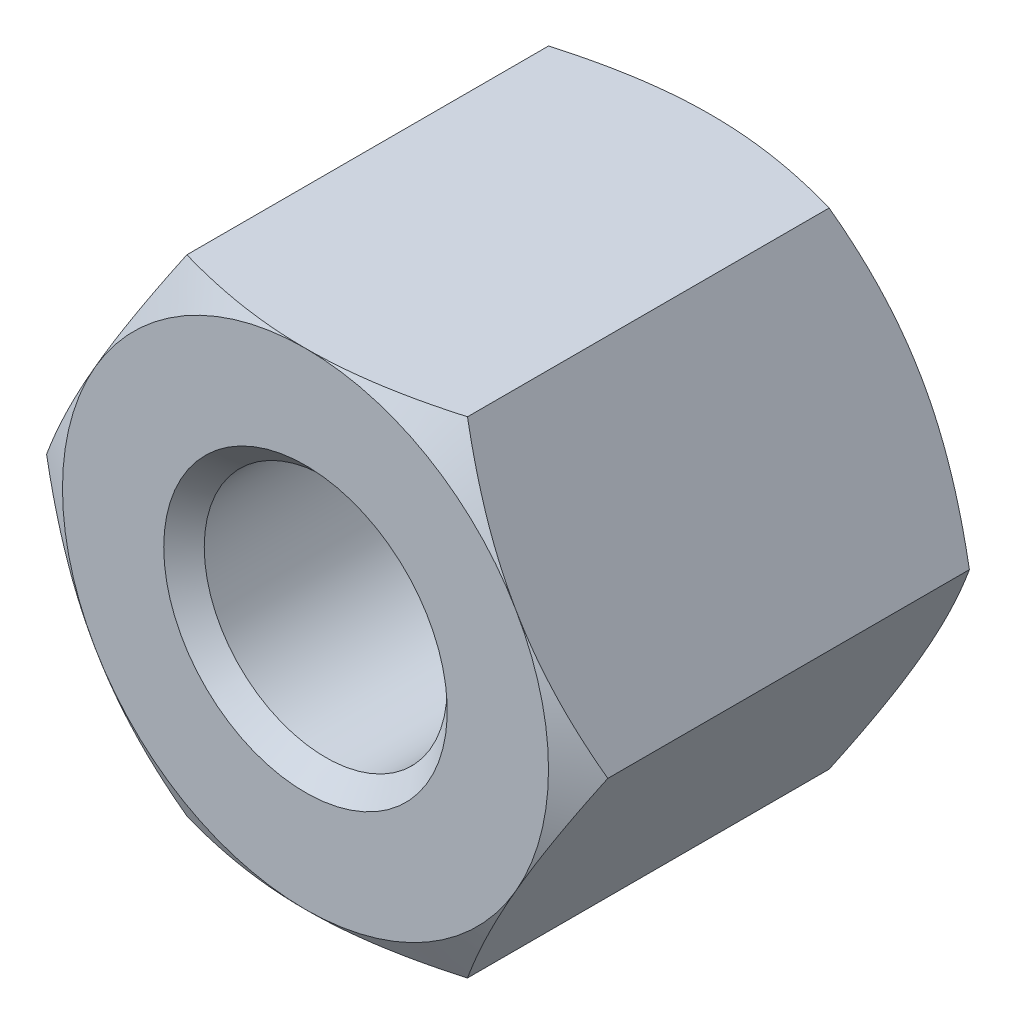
ISO-10303-21;
HEADER;
FILE_DESCRIPTION(('STEP AP214'),'2;1');
FILE_NAME('part.step','',(''),(''),'','','');
FILE_SCHEMA(('AUTOMOTIVE_DESIGN { 1 0 10303 214 1 1 1 1 }'));
ENDSEC;
DATA;
#1=APPLICATION_CONTEXT('core data for automotive mechanical design processes');
#2=APPLICATION_PROTOCOL_DEFINITION('international standard','automotive_design',2000,#1);
#3=PRODUCT_CONTEXT('',#1,'mechanical');
#4=PRODUCT('Part','Part','',(#3));
#5=PRODUCT_RELATED_PRODUCT_CATEGORY('part','',(#4));
#6=PRODUCT_DEFINITION_FORMATION('','',#4);
#7=PRODUCT_DEFINITION_CONTEXT('part definition',#1,'design');
#8=PRODUCT_DEFINITION('design','',#6,#7);
#9=PRODUCT_DEFINITION_SHAPE('','',#8);
#10=(LENGTH_UNIT() NAMED_UNIT(*) SI_UNIT(.MILLI.,.METRE.));
#11=(NAMED_UNIT(*) PLANE_ANGLE_UNIT() SI_UNIT($,.RADIAN.));
#12=(NAMED_UNIT(*) SI_UNIT($,.STERADIAN.) SOLID_ANGLE_UNIT());
#13=UNCERTAINTY_MEASURE_WITH_UNIT(LENGTH_MEASURE(1.E-05),#10,'distance_accuracy_value','');
#14=(GEOMETRIC_REPRESENTATION_CONTEXT(3) GLOBAL_UNCERTAINTY_ASSIGNED_CONTEXT((#13)) GLOBAL_UNIT_ASSIGNED_CONTEXT((#10,
#11,#12)) REPRESENTATION_CONTEXT('',''));
#15=CARTESIAN_POINT('',(0.,0.,0.));
#16=DIRECTION('',(0.,0.,1.));
#17=DIRECTION('',(1.,0.,0.));
#18=AXIS2_PLACEMENT_3D('',#15,#16,#17);
#19=CARTESIAN_POINT('',(3.46410161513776,0.,-2.5));
#20=DIRECTION('',(0.866025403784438,0.5,0.));
#21=DIRECTION('',(-0.5,0.866025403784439,0.));
#22=AXIS2_PLACEMENT_3D('',#19,#20,#21);
#23=PLANE('',#22);
#24=CARTESIAN_POINT('',(3.46421708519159,-0.000199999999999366,2.23198413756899));
#25=CARTESIAN_POINT('',(3.38810199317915,0.131635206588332,2.27594629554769));
#26=CARTESIAN_POINT('',(3.31132988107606,0.26460840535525,2.31592841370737));
#27=CARTESIAN_POINT('',(3.15645624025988,0.532857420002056,2.38571791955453));
#28=CARTESIAN_POINT('',(3.078351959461,0.668138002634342,2.41550061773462));
#29=CARTESIAN_POINT('',(2.92311136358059,0.937022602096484,2.46186216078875));
#30=CARTESIAN_POINT('',(2.84599893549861,1.07058524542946,2.47874955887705));
#31=CARTESIAN_POINT('',(2.6914112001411,1.33833905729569,2.49891035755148));
#32=CARTESIAN_POINT('',(2.61393645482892,1.47252925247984,2.50220045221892));
#33=CARTESIAN_POINT('',(2.46916798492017,1.72327559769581,2.49535946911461));
#34=CARTESIAN_POINT('',(2.40185259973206,1.83986926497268,2.48690808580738));
#35=CARTESIAN_POINT('',(2.2676603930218,2.07229698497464,2.46012105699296));
#36=CARTESIAN_POINT('',(2.2007840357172,2.18813023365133,2.44177625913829));
#37=CARTESIAN_POINT('',(2.06631510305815,2.42103725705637,2.39591524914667));
#38=CARTESIAN_POINT('',(1.99873954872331,2.53808155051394,2.36820461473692));
#39=CARTESIAN_POINT('',(1.86459637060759,2.77042435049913,2.3053122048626));
#40=CARTESIAN_POINT('',(1.79802702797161,2.88572583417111,2.27014520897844));
#41=CARTESIAN_POINT('',(1.73193533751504,3.0002,2.23198413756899));
#42=B_SPLINE_CURVE_WITH_KNOTS('',3,(#24,#25,#26,#27,#28,#29,#30,#31,#32,#33,#34,#35,#36,#37,#38,
#39,#40,#41),.UNSPECIFIED.,.F.,.F.,(4,2,2,2,2,2,2,2,4),(0.,0.475539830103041,0.952222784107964,
1.41710776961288,1.88142182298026,2.28572436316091,2.69040156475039,3.10405572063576,
3.5168974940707),.UNSPECIFIED.);
#43=CARTESIAN_POINT('',(3.46410161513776,0.,2.23205080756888));
#44=VERTEX_POINT('',#43);
#45=CARTESIAN_POINT('',(2.59807621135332,1.5,2.5));
#46=VERTEX_POINT('',#45);
#47=EDGE_CURVE('E127',#44,#46,#42,.T.);
#48=ORIENTED_EDGE('',*,*,#47,.F.);
#49=DIRECTION('',(0.,0.,1.));
#50=VECTOR('',#49,1.);
#51=CARTESIAN_POINT('',(3.46410161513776,0.,-2.5));
#52=LINE('',#51,#50);
#53=CARTESIAN_POINT('',(3.46410161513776,0.,-2.23205080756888));
#54=VERTEX_POINT('',#53);
#55=EDGE_CURVE('E565',#54,#44,#52,.T.);
#56=ORIENTED_EDGE('',*,*,#55,.F.);
#57=CARTESIAN_POINT('',(3.46421708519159,-0.000199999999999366,-2.23198413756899));
#58=CARTESIAN_POINT('',(3.38810199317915,0.131635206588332,-2.27594629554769));
#59=CARTESIAN_POINT('',(3.31132988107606,0.26460840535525,-2.31592841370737));
#60=CARTESIAN_POINT('',(3.15645624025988,0.532857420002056,-2.38571791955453));
#61=CARTESIAN_POINT('',(3.078351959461,0.668138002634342,-2.41550061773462));
#62=CARTESIAN_POINT('',(2.92311136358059,0.937022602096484,-2.46186216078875));
#63=CARTESIAN_POINT('',(2.84599893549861,1.07058524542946,-2.47874955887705));
#64=CARTESIAN_POINT('',(2.6914112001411,1.33833905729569,-2.49891035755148));
#65=CARTESIAN_POINT('',(2.61393645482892,1.47252925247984,-2.50220045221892));
#66=CARTESIAN_POINT('',(2.46916798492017,1.72327559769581,-2.49535946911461));
#67=CARTESIAN_POINT('',(2.40185259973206,1.83986926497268,-2.48690808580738));
#68=CARTESIAN_POINT('',(2.2676603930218,2.07229698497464,-2.46012105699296));
#69=CARTESIAN_POINT('',(2.2007840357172,2.18813023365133,-2.44177625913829));
#70=CARTESIAN_POINT('',(2.06631510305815,2.42103725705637,-2.39591524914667));
#71=CARTESIAN_POINT('',(1.99873954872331,2.53808155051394,-2.36820461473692));
#72=CARTESIAN_POINT('',(1.86459637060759,2.77042435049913,-2.3053122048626));
#73=CARTESIAN_POINT('',(1.79802702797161,2.88572583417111,-2.27014520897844));
#74=CARTESIAN_POINT('',(1.73193533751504,3.0002,-2.23198413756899));
#75=B_SPLINE_CURVE_WITH_KNOTS('',3,(#57,#58,#59,#60,#61,#62,#63,#64,#65,#66,#67,#68,#69,#70,#71,
#72,#73,#74),.UNSPECIFIED.,.F.,.F.,(4,2,2,2,2,2,2,2,4),(0.,0.475539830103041,0.952222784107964,
1.41710776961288,1.88142182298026,2.28572436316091,2.69040156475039,3.10405572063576,
3.5168974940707),.UNSPECIFIED.);
#76=CARTESIAN_POINT('',(2.59807621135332,1.5,-2.5));
#77=VERTEX_POINT('',#76);
#78=EDGE_CURVE('E577',#54,#77,#75,.T.);
#79=ORIENTED_EDGE('',*,*,#78,.T.);
#80=CARTESIAN_POINT('',(1.73205080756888,3.,-2.23205080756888));
#81=VERTEX_POINT('',#80);
#82=EDGE_CURVE('E269',#77,#81,#75,.T.);
#83=ORIENTED_EDGE('',*,*,#82,.T.);
#84=DIRECTION('',(0.,0.,1.));
#85=VECTOR('',#84,1.);
#86=CARTESIAN_POINT('',(1.73205080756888,3.,-2.5));
#87=LINE('',#86,#85);
#88=CARTESIAN_POINT('',(1.73205080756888,3.,2.23205080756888));
#89=VERTEX_POINT('',#88);
#90=EDGE_CURVE('E159',#81,#89,#87,.T.);
#91=ORIENTED_EDGE('',*,*,#90,.T.);
#92=EDGE_CURVE('E140',#46,#89,#42,.T.);
#93=ORIENTED_EDGE('',*,*,#92,.F.);
#94=EDGE_LOOP('',(#48,#56,#79,#83,#91,#93));
#95=FACE_BOUND('',#94,.T.);
#96=ADVANCED_FACE('F41',(#95),#23,.T.);
#97=CARTESIAN_POINT('',(1.73205080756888,-3.,-2.5));
#98=DIRECTION('',(0.866025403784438,-0.5,0.));
#99=DIRECTION('',(0.5,0.866025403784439,0.));
#100=AXIS2_PLACEMENT_3D('',#97,#98,#99);
#101=PLANE('',#100);
#102=CARTESIAN_POINT('',(1.73193533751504,-3.0002,2.23198413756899));
#103=CARTESIAN_POINT('',(1.80805042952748,-2.86836479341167,2.2759462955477));
#104=CARTESIAN_POINT('',(1.88482254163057,-2.73539159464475,2.31592841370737));
#105=CARTESIAN_POINT('',(2.03969618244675,-2.46714257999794,2.38571791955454));
#106=CARTESIAN_POINT('',(2.11780046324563,-2.33186199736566,2.41550061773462));
#107=CARTESIAN_POINT('',(2.27304105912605,-2.06297739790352,2.46186216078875));
#108=CARTESIAN_POINT('',(2.35015348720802,-1.92941475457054,2.47874955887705));
#109=CARTESIAN_POINT('',(2.50474122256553,-1.66166094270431,2.49891035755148));
#110=CARTESIAN_POINT('',(2.58221596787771,-1.52747074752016,2.50220045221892));
#111=CARTESIAN_POINT('',(2.72698443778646,-1.27672440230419,2.49535946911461));
#112=CARTESIAN_POINT('',(2.79429982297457,-1.16013073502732,2.48690808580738));
#113=CARTESIAN_POINT('',(2.92849202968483,-0.927703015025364,2.46012105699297));
#114=CARTESIAN_POINT('',(2.99536838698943,-0.811869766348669,2.44177625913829));
#115=CARTESIAN_POINT('',(3.12983731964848,-0.578962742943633,2.39591524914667));
#116=CARTESIAN_POINT('',(3.19741287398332,-0.461918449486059,2.36820461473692));
#117=CARTESIAN_POINT('',(3.33155605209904,-0.229575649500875,2.3053122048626));
#118=CARTESIAN_POINT('',(3.39812539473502,-0.114274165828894,2.27014520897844));
#119=CARTESIAN_POINT('',(3.46421708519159,0.000200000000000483,2.23198413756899));
#120=B_SPLINE_CURVE_WITH_KNOTS('',3,(#102,#103,#104,#105,#106,#107,#108,#109,#110,#111,#112,
#113,#114,#115,#116,#117,#118,#119),.UNSPECIFIED.,.F.,.F.,(4,2,2,2,2,2,2,2,4),(0.,
0.47553983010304,0.952222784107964,1.41710776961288,1.88142182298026,2.28572436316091,
2.69040156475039,3.10405572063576,3.5168974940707),.UNSPECIFIED.);
#121=CARTESIAN_POINT('',(1.73205080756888,-3.,2.23205080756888));
#122=VERTEX_POINT('',#121);
#123=CARTESIAN_POINT('',(2.59807621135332,-1.5,2.5));
#124=VERTEX_POINT('',#123);
#125=EDGE_CURVE('E537',#122,#124,#120,.T.);
#126=ORIENTED_EDGE('',*,*,#125,.F.);
#127=DIRECTION('',(0.,0.,1.));
#128=VECTOR('',#127,1.);
#129=CARTESIAN_POINT('',(1.73205080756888,-3.,-2.5));
#130=LINE('',#129,#128);
#131=CARTESIAN_POINT('',(1.73205080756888,-3.,-2.23205080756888));
#132=VERTEX_POINT('',#131);
#133=EDGE_CURVE('E283',#132,#122,#130,.T.);
#134=ORIENTED_EDGE('',*,*,#133,.F.);
#135=CARTESIAN_POINT('',(1.73193533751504,-3.0002,-2.23198413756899));
#136=CARTESIAN_POINT('',(1.80805042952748,-2.86836479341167,-2.2759462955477));
#137=CARTESIAN_POINT('',(1.88482254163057,-2.73539159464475,-2.31592841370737));
#138=CARTESIAN_POINT('',(2.03969618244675,-2.46714257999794,-2.38571791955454));
#139=CARTESIAN_POINT('',(2.11780046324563,-2.33186199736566,-2.41550061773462));
#140=CARTESIAN_POINT('',(2.27304105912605,-2.06297739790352,-2.46186216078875));
#141=CARTESIAN_POINT('',(2.35015348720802,-1.92941475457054,-2.47874955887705));
#142=CARTESIAN_POINT('',(2.50474122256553,-1.66166094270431,-2.49891035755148));
#143=CARTESIAN_POINT('',(2.58221596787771,-1.52747074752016,-2.50220045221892));
#144=CARTESIAN_POINT('',(2.72698443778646,-1.27672440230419,-2.49535946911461));
#145=CARTESIAN_POINT('',(2.79429982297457,-1.16013073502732,-2.48690808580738));
#146=CARTESIAN_POINT('',(2.92849202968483,-0.927703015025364,-2.46012105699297));
#147=CARTESIAN_POINT('',(2.99536838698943,-0.81186976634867,-2.44177625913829));
#148=CARTESIAN_POINT('',(3.12983731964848,-0.578962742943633,-2.39591524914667));
#149=CARTESIAN_POINT('',(3.19741287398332,-0.461918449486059,-2.36820461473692));
#150=CARTESIAN_POINT('',(3.33155605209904,-0.229575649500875,-2.3053122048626));
#151=CARTESIAN_POINT('',(3.39812539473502,-0.114274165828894,-2.27014520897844));
#152=CARTESIAN_POINT('',(3.46421708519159,0.000200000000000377,-2.23198413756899));
#153=B_SPLINE_CURVE_WITH_KNOTS('',3,(#135,#136,#137,#138,#139,#140,#141,#142,#143,#144,#145,
#146,#147,#148,#149,#150,#151,#152),.UNSPECIFIED.,.F.,.F.,(4,2,2,2,2,2,2,2,4),(0.,
0.47553983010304,0.952222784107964,1.41710776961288,1.88142182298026,2.28572436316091,
2.69040156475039,3.10405572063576,3.5168974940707),.UNSPECIFIED.);
#154=CARTESIAN_POINT('',(2.59807621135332,-1.5,-2.5));
#155=VERTEX_POINT('',#154);
#156=EDGE_CURVE('E566',#132,#155,#153,.T.);
#157=ORIENTED_EDGE('',*,*,#156,.T.);
#158=EDGE_CURVE('E284',#155,#54,#153,.T.);
#159=ORIENTED_EDGE('',*,*,#158,.T.);
#160=ORIENTED_EDGE('',*,*,#55,.T.);
#161=EDGE_CURVE('E132',#124,#44,#120,.T.);
#162=ORIENTED_EDGE('',*,*,#161,.F.);
#163=EDGE_LOOP('',(#126,#134,#157,#159,#160,#162));
#164=FACE_BOUND('',#163,.T.);
#165=ADVANCED_FACE('F254',(#164),#101,.T.);
#166=CARTESIAN_POINT('',(-1.73205080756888,-3.,-2.5));
#167=DIRECTION('',(0.,-1.,0.));
#168=DIRECTION('',(0.,0.,-1.));
#169=AXIS2_PLACEMENT_3D('',#166,#167,#168);
#170=PLANE('',#169);
#171=CARTESIAN_POINT('',(-7.17784978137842,-3.,-0.259479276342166));
#172=CARTESIAN_POINT('',(-7.01558245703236,-3.,-0.17304899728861));
#173=CARTESIAN_POINT('',(-6.85314037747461,-3.,-0.0869447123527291));
#174=CARTESIAN_POINT('',(-6.52782194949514,-3.,0.0844422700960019));
#175=CARTESIAN_POINT('',(-6.36494559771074,-3.,0.169724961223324));
#176=CARTESIAN_POINT('',(-6.03850024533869,-3.,0.339389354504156));
#177=CARTESIAN_POINT('',(-5.87493068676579,-3.,0.423769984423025));
#178=CARTESIAN_POINT('',(-5.54716008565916,-3.,0.59130132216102));
#179=CARTESIAN_POINT('',(-5.38295903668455,-3.,0.674452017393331));
#180=CARTESIAN_POINT('',(-5.04495709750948,-3.,0.843633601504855));
#181=CARTESIAN_POINT('',(-4.87111370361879,-3.,0.929579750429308));
#182=CARTESIAN_POINT('',(-4.5223603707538,-3.,1.09927115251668));
#183=CARTESIAN_POINT('',(-4.34745046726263,-3.,1.18301647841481));
#184=CARTESIAN_POINT('',(-3.99636183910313,-3.,1.34758690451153));
#185=CARTESIAN_POINT('',(-3.8201837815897,-3.,1.42841342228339));
#186=CARTESIAN_POINT('',(-3.46607843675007,-3.,1.58623509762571));
#187=CARTESIAN_POINT('',(-3.28815088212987,-3.,1.66322965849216));
#188=CARTESIAN_POINT('',(-2.91647223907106,-3.,1.8176583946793));
#189=CARTESIAN_POINT('',(-2.72254790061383,-3.,1.89467962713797));
#190=CARTESIAN_POINT('',(-2.33152787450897,-3.,2.04012175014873));
#191=CARTESIAN_POINT('',(-2.13443332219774,-3.,2.10854564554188));
#192=CARTESIAN_POINT('',(-1.74010191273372,-3.,2.23196477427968));
#193=CARTESIAN_POINT('',(-1.54293858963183,-3.,2.28718999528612));
#194=CARTESIAN_POINT('',(-1.14468045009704,-3.,2.38115539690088));
#195=CARTESIAN_POINT('',(-0.943587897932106,-3.,2.41990479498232));
#196=CARTESIAN_POINT('',(-0.575005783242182,-3.,2.47092360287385));
#197=CARTESIAN_POINT('',(-0.408015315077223,-3.,2.48671427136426));
#198=CARTESIAN_POINT('',(-0.073326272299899,-3.,2.50215643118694));
#199=CARTESIAN_POINT('',(0.0943720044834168,-3.,2.50181414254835));
#200=CARTESIAN_POINT('',(0.43190307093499,-3.,2.48488633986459));
#201=CARTESIAN_POINT('',(0.601721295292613,-3.,2.46801424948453));
#202=CARTESIAN_POINT('',(0.854800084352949,-3.,2.43168509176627));
#203=CARTESIAN_POINT('',(0.938905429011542,-3.,2.41773374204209));
#204=CARTESIAN_POINT('',(1.10649467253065,-3.,2.38651079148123));
#205=CARTESIAN_POINT('',(1.18997860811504,-3.,2.36923938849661));
#206=CARTESIAN_POINT('',(1.408843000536,-3.,2.31987785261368));
#207=CARTESIAN_POINT('',(1.54366734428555,-3.,2.28532210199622));
#208=CARTESIAN_POINT('',(1.81152764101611,-3.,2.20984458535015));
#209=CARTESIAN_POINT('',(1.94456313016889,-3.,2.16892120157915));
#210=CARTESIAN_POINT('',(2.20914170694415,-3.,2.08197641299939));
#211=CARTESIAN_POINT('',(2.34068255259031,-3.,2.03594824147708));
#212=CARTESIAN_POINT('',(2.60227812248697,-3.,1.93991466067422));
#213=CARTESIAN_POINT('',(2.73233299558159,-3.,1.88990965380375));
#214=CARTESIAN_POINT('',(2.99202121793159,-3.,1.78642175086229));
#215=CARTESIAN_POINT('',(3.12164639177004,-3.,1.73291844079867));
#216=CARTESIAN_POINT('',(3.37982130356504,-3.,1.62337600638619));
#217=CARTESIAN_POINT('',(3.50837100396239,-3.,1.56733679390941));
#218=CARTESIAN_POINT('',(3.89248803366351,-3.,1.39628235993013));
#219=CARTESIAN_POINT('',(4.1467116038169,-3.,1.27825347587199));
#220=CARTESIAN_POINT('',(4.63589269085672,-3.,1.04489196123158));
#221=CARTESIAN_POINT('',(4.87101297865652,-3.,0.929896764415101));
#222=CARTESIAN_POINT('',(5.33966516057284,-3.,0.696613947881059));
#223=CARTESIAN_POINT('',(5.57319675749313,-3.,0.578325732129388));
#224=CARTESIAN_POINT('',(6.03578043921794,-3.,0.34105697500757));
#225=CARTESIAN_POINT('',(6.2648494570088,-3.,0.22210932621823));
#226=CARTESIAN_POINT('',(6.72200542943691,-3.,-0.0175153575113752));
#227=CARTESIAN_POINT('',(6.95009262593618,-3.,-0.13819193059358));
#228=CARTESIAN_POINT('',(7.17784978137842,-3.,-0.259479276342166));
#229=B_SPLINE_CURVE_WITH_KNOTS('',3,(#171,#172,#173,#174,#175,#176,#177,#178,#179,#180,#181,
#182,#183,#184,#185,#186,#187,#188,#189,#190,#191,#192,#193,#194,#195,#196,#197,#198,#199,#200,
#201,#202,#203,#204,#205,#206,#207,#208,#209,#210,#211,#212,#213,#214,#215,#216,#217,#218,#219,
#220,#221,#222,#223,#224,#225,#226,#227,#228),.UNSPECIFIED.,.F.,.F.,(4,2,2,2,2,2,2,2,2,2,2,2,2,
2,2,2,2,2,2,2,2,2,2,2,2,2,2,2,4),(0.,0.55155154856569,1.10310738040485,1.6552587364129,
2.20741573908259,2.78918936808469,3.37094374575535,3.95241167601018,4.53396986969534,
5.15981071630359,5.78543221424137,6.39919323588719,7.01261043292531,7.51510497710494,
8.0174057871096,8.52857189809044,8.78428091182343,9.03997469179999,9.4573109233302,
9.8747533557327,10.2927559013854,10.7107162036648,11.1313814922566,11.5520614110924,
12.3928113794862,13.177990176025,13.9633120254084,14.7376363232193,15.5117574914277),.UNSPECIFIED.);
#230=CARTESIAN_POINT('',(-1.73205080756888,-3.,2.23205080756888));
#231=VERTEX_POINT('',#230);
#232=CARTESIAN_POINT('',(0.,-3.,2.5));
#233=VERTEX_POINT('',#232);
#234=EDGE_CURVE('E538',#231,#233,#229,.T.);
#235=ORIENTED_EDGE('',*,*,#234,.F.);
#236=DIRECTION('',(0.,0.,1.));
#237=VECTOR('',#236,1.);
#238=CARTESIAN_POINT('',(-1.73205080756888,-3.,-2.5));
#239=LINE('',#238,#237);
#240=CARTESIAN_POINT('',(-1.73205080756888,-3.,-2.23205080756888));
#241=VERTEX_POINT('',#240);
#242=EDGE_CURVE('E545',#241,#231,#239,.T.);
#243=ORIENTED_EDGE('',*,*,#242,.F.);
#244=CARTESIAN_POINT('',(-5.96096657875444,-3.,-0.379211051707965));
#245=CARTESIAN_POINT('',(-5.82229549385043,-3.,-0.450717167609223));
#246=CARTESIAN_POINT('',(-5.68342500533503,-3.,-0.521839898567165));
#247=CARTESIAN_POINT('',(-5.4051938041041,-3.,-0.663125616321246));
#248=CARTESIAN_POINT('',(-5.26583308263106,-3.,-0.733288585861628));
#249=CARTESIAN_POINT('',(-4.98631052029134,-3.,-0.872571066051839));
#250=CARTESIAN_POINT('',(-4.84614775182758,-3.,-0.941688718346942));
#251=CARTESIAN_POINT('',(-4.56512520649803,-3.,-1.07849952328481));
#252=CARTESIAN_POINT('',(-4.42426541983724,-3.,-1.14619265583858));
#253=CARTESIAN_POINT('',(-4.13421051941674,-3.,-1.28335591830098));
#254=CARTESIAN_POINT('',(-3.98496973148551,-3.,-1.35272973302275));
#255=CARTESIAN_POINT('',(-3.68535367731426,-3.,-1.48898030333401));
#256=CARTESIAN_POINT('',(-3.53497844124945,-3.,-1.55585712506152));
#257=CARTESIAN_POINT('',(-3.23293144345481,-3.,-1.68634814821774));
#258=CARTESIAN_POINT('',(-3.08126062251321,-3.,-1.74996451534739));
#259=CARTESIAN_POINT('',(-2.77617994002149,-3.,-1.87300741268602));
#260=CARTESIAN_POINT('',(-2.62276968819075,-3.,-1.93243298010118));
#261=CARTESIAN_POINT('',(-2.28978004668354,-3.,-2.05458664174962));
#262=CARTESIAN_POINT('',(-2.10985340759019,-3.,-2.11638252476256));
#263=CARTESIAN_POINT('',(-1.74684035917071,-3.,-2.22970634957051));
#264=CARTESIAN_POINT('',(-1.56375558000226,-3.,-2.28123942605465));
#265=CARTESIAN_POINT('',(-1.19765579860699,-3.,-2.36949196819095));
#266=CARTESIAN_POINT('',(-1.01470769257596,-3.,-2.40647822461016));
#267=CARTESIAN_POINT('',(-0.73834410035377,-3.,-2.44905252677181));
#268=CARTESIAN_POINT('',(-0.645908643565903,-3.,-2.46109255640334));
#269=CARTESIAN_POINT('',(-0.460553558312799,-3.,-2.48049771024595));
#270=CARTESIAN_POINT('',(-0.367634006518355,-3.,-2.48786355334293));
#271=CARTESIAN_POINT('',(-0.180216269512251,-3.,-2.49772601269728));
#272=CARTESIAN_POINT('',(-0.0857143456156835,-3.,-2.50015228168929));
#273=CARTESIAN_POINT('',(0.103280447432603,-3.,-2.49983287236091));
#274=CARTESIAN_POINT('',(0.197773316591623,-3.,-2.49708719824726));
#275=CARTESIAN_POINT('',(0.386491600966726,-3.,-2.48652759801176));
#276=CARTESIAN_POINT('',(0.480716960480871,-3.,-2.47871268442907));
#277=CARTESIAN_POINT('',(0.66865400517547,-3.,-2.45830072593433));
#278=CARTESIAN_POINT('',(0.762365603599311,-3.,-2.44570289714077));
#279=CARTESIAN_POINT('',(1.04621628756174,-3.,-2.40074314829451));
#280=CARTESIAN_POINT('',(1.23527267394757,-3.,-2.36145296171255));
#281=CARTESIAN_POINT('',(1.60983106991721,-3.,-2.26882483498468));
#282=CARTESIAN_POINT('',(1.79533187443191,-3.,-2.21548221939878));
#283=CARTESIAN_POINT('',(2.15763999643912,-3.,-2.10028779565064));
#284=CARTESIAN_POINT('',(2.33454275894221,-3.,-2.0387312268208));
#285=CARTESIAN_POINT('',(2.68576747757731,-3.,-1.90860477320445));
#286=CARTESIAN_POINT('',(2.86008876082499,-3.,-1.8400330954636));
#287=CARTESIAN_POINT('',(3.2068164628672,-3.,-1.69769936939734));
#288=CARTESIAN_POINT('',(3.37922045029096,-3.,-1.62393144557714));
#289=CARTESIAN_POINT('',(3.72232923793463,-3.,-1.47261306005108));
#290=CARTESIAN_POINT('',(3.89303421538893,-3.,-1.39506299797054));
#291=CARTESIAN_POINT('',(4.22332235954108,-3.,-1.24165474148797));
#292=CARTESIAN_POINT('',(4.38297998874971,-3.,-1.16595621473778));
#293=CARTESIAN_POINT('',(4.70134647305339,-3.,-1.01258026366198));
#294=CARTESIAN_POINT('',(4.86005529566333,-3.,-0.934902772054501));
#295=CARTESIAN_POINT('',(5.17616234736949,-3.,-0.778256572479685));
#296=CARTESIAN_POINT('',(5.33356319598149,-3.,-0.699293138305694));
#297=CARTESIAN_POINT('',(5.64771538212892,-3.,-0.54011749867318));
#298=CARTESIAN_POINT('',(5.80446677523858,-3.,-0.459905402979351));
#299=CARTESIAN_POINT('',(5.96096657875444,-3.,-0.379211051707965));
#300=B_SPLINE_CURVE_WITH_KNOTS('',3,(#244,#245,#246,#247,#248,#249,#250,#251,#252,#253,#254,
#255,#256,#257,#258,#259,#260,#261,#262,#263,#264,#265,#266,#267,#268,#269,#270,#271,#272,#273,
#274,#275,#276,#277,#278,#279,#280,#281,#282,#283,#284,#285,#286,#287,#288,#289,#290,#291,#292,
#293,#294,#295,#296,#297,#298,#299),.UNSPECIFIED.,.F.,.F.,(4,2,2,2,2,2,2,2,2,2,2,2,2,2,2,2,2,2,
2,2,2,2,2,2,2,2,2,4),(0.,0.468066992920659,0.93614239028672,1.40497010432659,1.87380442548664,
2.36751699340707,2.86121647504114,3.3545836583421,3.84806382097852,4.41856654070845,
4.98878310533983,5.54799077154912,5.82753886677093,6.10704395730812,6.39050255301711,
6.67396091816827,6.95747451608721,7.24103459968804,7.81952256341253,8.39820324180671,
8.95992231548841,9.52178531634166,10.0842941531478,10.6467436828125,11.1768095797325,
11.7068935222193,12.2351793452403,12.7634189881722),.UNSPECIFIED.);
#301=CARTESIAN_POINT('',(0.,-3.,-2.5));
#302=VERTEX_POINT('',#301);
#303=EDGE_CURVE('E534',#241,#302,#300,.T.);
#304=ORIENTED_EDGE('',*,*,#303,.T.);
#305=EDGE_CURVE('E259',#302,#132,#300,.T.);
#306=ORIENTED_EDGE('',*,*,#305,.T.);
#307=ORIENTED_EDGE('',*,*,#133,.T.);
#308=EDGE_CURVE('E138',#233,#122,#229,.T.);
#309=ORIENTED_EDGE('',*,*,#308,.F.);
#310=EDGE_LOOP('',(#235,#243,#304,#306,#307,#309));
#311=FACE_BOUND('',#310,.T.);
#312=ADVANCED_FACE('F292',(#311),#170,.T.);
#313=CARTESIAN_POINT('',(-3.46410161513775,0.,-2.5));
#314=DIRECTION('',(-0.866025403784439,-0.5,0.));
#315=DIRECTION('',(0.5,-0.866025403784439,0.));
#316=AXIS2_PLACEMENT_3D('',#313,#314,#315);
#317=PLANE('',#316);
#318=CARTESIAN_POINT('',(-3.46421708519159,0.000200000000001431,2.23198413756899));
#319=CARTESIAN_POINT('',(-3.38810199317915,-0.131635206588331,2.2759462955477));
#320=CARTESIAN_POINT('',(-3.31132988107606,-0.264608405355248,2.31592841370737));
#321=CARTESIAN_POINT('',(-3.15645624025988,-0.532857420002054,2.38571791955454));
#322=CARTESIAN_POINT('',(-3.078351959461,-0.66813800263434,2.41550061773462));
#323=CARTESIAN_POINT('',(-2.92311136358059,-0.937022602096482,2.46186216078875));
#324=CARTESIAN_POINT('',(-2.84599893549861,-1.07058524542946,2.47874955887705));
#325=CARTESIAN_POINT('',(-2.6914112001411,-1.33833905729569,2.49891035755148));
#326=CARTESIAN_POINT('',(-2.61393645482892,-1.47252925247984,2.50220045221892));
#327=CARTESIAN_POINT('',(-2.46916798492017,-1.72327559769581,2.49535946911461));
#328=CARTESIAN_POINT('',(-2.40185259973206,-1.83986926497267,2.48690808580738));
#329=CARTESIAN_POINT('',(-2.2676603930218,-2.07229698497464,2.46012105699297));
#330=CARTESIAN_POINT('',(-2.2007840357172,-2.18813023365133,2.44177625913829));
#331=CARTESIAN_POINT('',(-2.06631510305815,-2.42103725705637,2.39591524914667));
#332=CARTESIAN_POINT('',(-1.99873954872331,-2.53808155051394,2.36820461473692));
#333=CARTESIAN_POINT('',(-1.86459637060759,-2.77042435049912,2.3053122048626));
#334=CARTESIAN_POINT('',(-1.79802702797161,-2.88572583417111,2.27014520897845));
#335=CARTESIAN_POINT('',(-1.73193533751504,-3.0002,2.23198413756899));
#336=B_SPLINE_CURVE_WITH_KNOTS('',3,(#318,#319,#320,#321,#322,#323,#324,#325,#326,#327,#328,
#329,#330,#331,#332,#333,#334,#335),.UNSPECIFIED.,.F.,.F.,(4,2,2,2,2,2,2,2,4),(0.,
0.475539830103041,0.952222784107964,1.41710776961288,1.88142182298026,2.28572436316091,
2.69040156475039,3.10405572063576,3.5168974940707),.UNSPECIFIED.);
#337=CARTESIAN_POINT('',(-3.46410161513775,0.,2.23205080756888));
#338=VERTEX_POINT('',#337);
#339=CARTESIAN_POINT('',(-2.59807621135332,-1.5,2.5));
#340=VERTEX_POINT('',#339);
#341=EDGE_CURVE('E176',#338,#340,#336,.T.);
#342=ORIENTED_EDGE('',*,*,#341,.F.);
#343=DIRECTION('',(0.,0.,1.));
#344=VECTOR('',#343,1.);
#345=CARTESIAN_POINT('',(-3.46410161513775,0.,-2.5));
#346=LINE('',#345,#344);
#347=CARTESIAN_POINT('',(-3.46410161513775,0.,-2.23205080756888));
#348=VERTEX_POINT('',#347);
#349=EDGE_CURVE('E553',#348,#338,#346,.T.);
#350=ORIENTED_EDGE('',*,*,#349,.F.);
#351=CARTESIAN_POINT('',(-3.46421708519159,0.000200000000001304,-2.23198413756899));
#352=CARTESIAN_POINT('',(-3.38810199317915,-0.131635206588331,-2.2759462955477));
#353=CARTESIAN_POINT('',(-3.31132988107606,-0.264608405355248,-2.31592841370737));
#354=CARTESIAN_POINT('',(-3.15645624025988,-0.532857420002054,-2.38571791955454));
#355=CARTESIAN_POINT('',(-3.078351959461,-0.66813800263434,-2.41550061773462));
#356=CARTESIAN_POINT('',(-2.92311136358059,-0.937022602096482,-2.46186216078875));
#357=CARTESIAN_POINT('',(-2.84599893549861,-1.07058524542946,-2.47874955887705));
#358=CARTESIAN_POINT('',(-2.6914112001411,-1.33833905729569,-2.49891035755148));
#359=CARTESIAN_POINT('',(-2.61393645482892,-1.47252925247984,-2.50220045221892));
#360=CARTESIAN_POINT('',(-2.46916798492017,-1.72327559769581,-2.49535946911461));
#361=CARTESIAN_POINT('',(-2.40185259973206,-1.83986926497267,-2.48690808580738));
#362=CARTESIAN_POINT('',(-2.2676603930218,-2.07229698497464,-2.46012105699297));
#363=CARTESIAN_POINT('',(-2.2007840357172,-2.18813023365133,-2.44177625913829));
#364=CARTESIAN_POINT('',(-2.06631510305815,-2.42103725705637,-2.39591524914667));
#365=CARTESIAN_POINT('',(-1.99873954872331,-2.53808155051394,-2.36820461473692));
#366=CARTESIAN_POINT('',(-1.86459637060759,-2.77042435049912,-2.3053122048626));
#367=CARTESIAN_POINT('',(-1.79802702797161,-2.88572583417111,-2.27014520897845));
#368=CARTESIAN_POINT('',(-1.73193533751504,-3.0002,-2.23198413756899));
#369=B_SPLINE_CURVE_WITH_KNOTS('',3,(#351,#352,#353,#354,#355,#356,#357,#358,#359,#360,#361,
#362,#363,#364,#365,#366,#367,#368),.UNSPECIFIED.,.F.,.F.,(4,2,2,2,2,2,2,2,4),(0.,
0.475539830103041,0.952222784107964,1.41710776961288,1.88142182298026,2.28572436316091,
2.69040156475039,3.10405572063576,3.5168974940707),.UNSPECIFIED.);
#370=CARTESIAN_POINT('',(-2.59807621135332,-1.5,-2.5));
#371=VERTEX_POINT('',#370);
#372=EDGE_CURVE('E275',#348,#371,#369,.T.);
#373=ORIENTED_EDGE('',*,*,#372,.T.);
#374=EDGE_CURVE('E282',#371,#241,#369,.T.);
#375=ORIENTED_EDGE('',*,*,#374,.T.);
#376=ORIENTED_EDGE('',*,*,#242,.T.);
#377=EDGE_CURVE('E548',#340,#231,#336,.T.);
#378=ORIENTED_EDGE('',*,*,#377,.F.);
#379=EDGE_LOOP('',(#342,#350,#373,#375,#376,#378));
#380=FACE_BOUND('',#379,.T.);
#381=ADVANCED_FACE('F289',(#380),#317,.T.);
#382=CARTESIAN_POINT('',(-1.73205080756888,3.,-2.5));
#383=DIRECTION('',(-0.866025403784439,0.5,0.));
#384=DIRECTION('',(-0.5,-0.866025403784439,0.));
#385=AXIS2_PLACEMENT_3D('',#382,#383,#384);
#386=PLANE('',#385);
#387=CARTESIAN_POINT('',(-1.73193533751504,3.0002,2.23198413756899));
#388=CARTESIAN_POINT('',(-1.80805042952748,2.86836479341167,2.27594629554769));
#389=CARTESIAN_POINT('',(-1.88482254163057,2.73539159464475,2.31592841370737));
#390=CARTESIAN_POINT('',(-2.03969618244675,2.46714257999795,2.38571791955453));
#391=CARTESIAN_POINT('',(-2.11780046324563,2.33186199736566,2.41550061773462));
#392=CARTESIAN_POINT('',(-2.27304105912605,2.06297739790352,2.46186216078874));
#393=CARTESIAN_POINT('',(-2.35015348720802,1.92941475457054,2.47874955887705));
#394=CARTESIAN_POINT('',(-2.50474122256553,1.66166094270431,2.49891035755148));
#395=CARTESIAN_POINT('',(-2.58221596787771,1.52747074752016,2.50220045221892));
#396=CARTESIAN_POINT('',(-2.72698443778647,1.27672440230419,2.49535946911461));
#397=CARTESIAN_POINT('',(-2.79429982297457,1.16013073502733,2.48690808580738));
#398=CARTESIAN_POINT('',(-2.92849202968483,0.927703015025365,2.46012105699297));
#399=CARTESIAN_POINT('',(-2.99536838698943,0.81186976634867,2.44177625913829));
#400=CARTESIAN_POINT('',(-3.12983731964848,0.578962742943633,2.39591524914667));
#401=CARTESIAN_POINT('',(-3.19741287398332,0.46191844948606,2.36820461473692));
#402=CARTESIAN_POINT('',(-3.33155605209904,0.229575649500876,2.3053122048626));
#403=CARTESIAN_POINT('',(-3.39812539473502,0.114274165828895,2.27014520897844));
#404=CARTESIAN_POINT('',(-3.46421708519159,-0.000199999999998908,2.23198413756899));
#405=B_SPLINE_CURVE_WITH_KNOTS('',3,(#387,#388,#389,#390,#391,#392,#393,#394,#395,#396,#397,
#398,#399,#400,#401,#402,#403,#404),.UNSPECIFIED.,.F.,.F.,(4,2,2,2,2,2,2,2,4),(0.,
0.47553983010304,0.952222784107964,1.41710776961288,1.88142182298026,2.28572436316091,
2.69040156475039,3.10405572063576,3.5168974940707),.UNSPECIFIED.);
#406=CARTESIAN_POINT('',(-1.73205080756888,3.,2.23205080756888));
#407=VERTEX_POINT('',#406);
#408=CARTESIAN_POINT('',(-2.59807621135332,1.5,2.5));
#409=VERTEX_POINT('',#408);
#410=EDGE_CURVE('E183',#407,#409,#405,.T.);
#411=ORIENTED_EDGE('',*,*,#410,.F.);
#412=DIRECTION('',(0.,0.,1.));
#413=VECTOR('',#412,1.);
#414=CARTESIAN_POINT('',(-1.73205080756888,3.,-2.5));
#415=LINE('',#414,#413);
#416=CARTESIAN_POINT('',(-1.73205080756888,3.,-2.23205080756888));
#417=VERTEX_POINT('',#416);
#418=EDGE_CURVE('E233',#417,#407,#415,.T.);
#419=ORIENTED_EDGE('',*,*,#418,.F.);
#420=CARTESIAN_POINT('',(-1.73193533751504,3.0002,-2.23198413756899));
#421=CARTESIAN_POINT('',(-1.80805042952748,2.86836479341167,-2.27594629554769));
#422=CARTESIAN_POINT('',(-1.88482254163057,2.73539159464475,-2.31592841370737));
#423=CARTESIAN_POINT('',(-2.03969618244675,2.46714257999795,-2.38571791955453));
#424=CARTESIAN_POINT('',(-2.11780046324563,2.33186199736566,-2.41550061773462));
#425=CARTESIAN_POINT('',(-2.27304105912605,2.06297739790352,-2.46186216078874));
#426=CARTESIAN_POINT('',(-2.35015348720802,1.92941475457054,-2.47874955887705));
#427=CARTESIAN_POINT('',(-2.50474122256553,1.66166094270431,-2.49891035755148));
#428=CARTESIAN_POINT('',(-2.58221596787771,1.52747074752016,-2.50220045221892));
#429=CARTESIAN_POINT('',(-2.72698443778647,1.27672440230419,-2.49535946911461));
#430=CARTESIAN_POINT('',(-2.79429982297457,1.16013073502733,-2.48690808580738));
#431=CARTESIAN_POINT('',(-2.92849202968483,0.927703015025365,-2.46012105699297));
#432=CARTESIAN_POINT('',(-2.99536838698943,0.81186976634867,-2.44177625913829));
#433=CARTESIAN_POINT('',(-3.12983731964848,0.578962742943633,-2.39591524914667));
#434=CARTESIAN_POINT('',(-3.19741287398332,0.46191844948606,-2.36820461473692));
#435=CARTESIAN_POINT('',(-3.33155605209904,0.229575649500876,-2.3053122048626));
#436=CARTESIAN_POINT('',(-3.39812539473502,0.114274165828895,-2.27014520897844));
#437=CARTESIAN_POINT('',(-3.46421708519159,-0.000199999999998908,-2.23198413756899));
#438=B_SPLINE_CURVE_WITH_KNOTS('',3,(#420,#421,#422,#423,#424,#425,#426,#427,#428,#429,#430,
#431,#432,#433,#434,#435,#436,#437),.UNSPECIFIED.,.F.,.F.,(4,2,2,2,2,2,2,2,4),(0.,
0.47553983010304,0.952222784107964,1.41710776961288,1.88142182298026,2.28572436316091,
2.69040156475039,3.10405572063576,3.5168974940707),.UNSPECIFIED.);
#439=CARTESIAN_POINT('',(-2.59807621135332,1.5,-2.5));
#440=VERTEX_POINT('',#439);
#441=EDGE_CURVE('E237',#417,#440,#438,.T.);
#442=ORIENTED_EDGE('',*,*,#441,.T.);
#443=EDGE_CURVE('E544',#440,#348,#438,.T.);
#444=ORIENTED_EDGE('',*,*,#443,.T.);
#445=ORIENTED_EDGE('',*,*,#349,.T.);
#446=EDGE_CURVE('E607',#409,#338,#405,.T.);
#447=ORIENTED_EDGE('',*,*,#446,.F.);
#448=EDGE_LOOP('',(#411,#419,#442,#444,#445,#447));
#449=FACE_BOUND('',#448,.T.);
#450=ADVANCED_FACE('F218',(#449),#386,.T.);
#451=CARTESIAN_POINT('',(1.73205080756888,3.,-2.5));
#452=DIRECTION('',(0.,1.,0.));
#453=DIRECTION('',(-1.,0.,0.));
#454=AXIS2_PLACEMENT_3D('',#451,#452,#453);
#455=PLANE('',#454);
#456=CARTESIAN_POINT('',(7.17784978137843,3.,-0.25947927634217));
#457=CARTESIAN_POINT('',(7.01558245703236,3.,-0.173048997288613));
#458=CARTESIAN_POINT('',(6.85314037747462,3.,-0.0869447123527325));
#459=CARTESIAN_POINT('',(6.52782194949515,3.,0.0844422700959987));
#460=CARTESIAN_POINT('',(6.36494559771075,3.,0.169724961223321));
#461=CARTESIAN_POINT('',(6.03850024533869,3.,0.339389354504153));
#462=CARTESIAN_POINT('',(5.8749306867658,3.,0.423769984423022));
#463=CARTESIAN_POINT('',(5.54716008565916,3.,0.591301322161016));
#464=CARTESIAN_POINT('',(5.38295903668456,3.,0.674452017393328));
#465=CARTESIAN_POINT('',(5.04495709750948,3.,0.843633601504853));
#466=CARTESIAN_POINT('',(4.8711137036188,3.,0.929579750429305));
#467=CARTESIAN_POINT('',(4.5223603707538,3.,1.09927115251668));
#468=CARTESIAN_POINT('',(4.34745046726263,3.,1.18301647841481));
#469=CARTESIAN_POINT('',(3.99636183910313,3.,1.34758690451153));
#470=CARTESIAN_POINT('',(3.8201837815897,3.,1.42841342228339));
#471=CARTESIAN_POINT('',(3.46607843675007,3.,1.58623509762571));
#472=CARTESIAN_POINT('',(3.28815088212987,3.,1.66322965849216));
#473=CARTESIAN_POINT('',(2.91647223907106,3.,1.8176583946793));
#474=CARTESIAN_POINT('',(2.72254790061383,3.,1.89467962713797));
#475=CARTESIAN_POINT('',(2.33152787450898,3.,2.04012175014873));
#476=CARTESIAN_POINT('',(2.13443332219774,3.,2.10854564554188));
#477=CARTESIAN_POINT('',(1.74010191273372,3.,2.23196477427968));
#478=CARTESIAN_POINT('',(1.54293858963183,3.,2.28718999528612));
#479=CARTESIAN_POINT('',(1.14468045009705,3.,2.38115539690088));
#480=CARTESIAN_POINT('',(0.943587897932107,3.,2.41990479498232));
#481=CARTESIAN_POINT('',(0.575005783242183,3.,2.47092360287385));
#482=CARTESIAN_POINT('',(0.408015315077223,3.,2.48671427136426));
#483=CARTESIAN_POINT('',(0.073326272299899,3.,2.50215643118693));
#484=CARTESIAN_POINT('',(-0.0943720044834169,3.,2.50181414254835));
#485=CARTESIAN_POINT('',(-0.43190307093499,3.,2.48488633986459));
#486=CARTESIAN_POINT('',(-0.601721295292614,3.,2.46801424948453));
#487=CARTESIAN_POINT('',(-0.854800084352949,3.,2.43168509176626));
#488=CARTESIAN_POINT('',(-0.938905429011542,3.,2.41773374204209));
#489=CARTESIAN_POINT('',(-1.10649467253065,3.,2.38651079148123));
#490=CARTESIAN_POINT('',(-1.18997860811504,3.,2.36923938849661));
#491=CARTESIAN_POINT('',(-1.40884300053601,3.,2.31987785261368));
#492=CARTESIAN_POINT('',(-1.54366734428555,3.,2.28532210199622));
#493=CARTESIAN_POINT('',(-1.81152764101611,3.,2.20984458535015));
#494=CARTESIAN_POINT('',(-1.94456313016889,3.,2.16892120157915));
#495=CARTESIAN_POINT('',(-2.20914170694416,3.,2.08197641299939));
#496=CARTESIAN_POINT('',(-2.34068255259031,3.,2.03594824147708));
#497=CARTESIAN_POINT('',(-2.60227812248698,3.,1.93991466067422));
#498=CARTESIAN_POINT('',(-2.73233299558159,3.,1.88990965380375));
#499=CARTESIAN_POINT('',(-2.9920212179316,3.,1.78642175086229));
#500=CARTESIAN_POINT('',(-3.12164639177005,3.,1.73291844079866));
#501=CARTESIAN_POINT('',(-3.37982130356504,3.,1.62337600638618));
#502=CARTESIAN_POINT('',(-3.5083710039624,3.,1.5673367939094));
#503=CARTESIAN_POINT('',(-3.89248803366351,3.,1.39628235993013));
#504=CARTESIAN_POINT('',(-4.14671160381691,3.,1.27825347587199));
#505=CARTESIAN_POINT('',(-4.63589269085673,3.,1.04489196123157));
#506=CARTESIAN_POINT('',(-4.87101297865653,3.,0.929896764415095));
#507=CARTESIAN_POINT('',(-5.33966516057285,3.,0.696613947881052));
#508=CARTESIAN_POINT('',(-5.57319675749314,3.,0.578325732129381));
#509=CARTESIAN_POINT('',(-6.03578043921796,3.,0.341056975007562));
#510=CARTESIAN_POINT('',(-6.26484945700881,3.,0.222109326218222));
#511=CARTESIAN_POINT('',(-6.72200542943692,3.,-0.0175153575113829));
#512=CARTESIAN_POINT('',(-6.95009262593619,3.,-0.138191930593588));
#513=CARTESIAN_POINT('',(-7.17784978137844,3.,-0.259479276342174));
#514=B_SPLINE_CURVE_WITH_KNOTS('',3,(#456,#457,#458,#459,#460,#461,#462,#463,#464,#465,#466,
#467,#468,#469,#470,#471,#472,#473,#474,#475,#476,#477,#478,#479,#480,#481,#482,#483,#484,#485,
#486,#487,#488,#489,#490,#491,#492,#493,#494,#495,#496,#497,#498,#499,#500,#501,#502,#503,#504,
#505,#506,#507,#508,#509,#510,#511,#512,#513),.UNSPECIFIED.,.F.,.F.,(4,2,2,2,2,2,2,2,2,2,2,2,2,
2,2,2,2,2,2,2,2,2,2,2,2,2,2,2,4),(0.,0.551551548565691,1.10310738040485,1.6552587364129,
2.20741573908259,2.78918936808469,3.37094374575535,3.95241167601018,4.53396986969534,
5.15981071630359,5.78543221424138,6.39919323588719,7.01261043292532,7.51510497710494,
8.0174057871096,8.52857189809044,8.78428091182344,9.03997469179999,9.45731092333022,
9.87475335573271,10.2927559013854,10.7107162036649,11.1313814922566,11.5520614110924,
12.3928113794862,13.177990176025,13.9633120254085,14.7376363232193,15.5117574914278),.UNSPECIFIED.);
#515=CARTESIAN_POINT('',(0.,3.,2.5));
#516=VERTEX_POINT('',#515);
#517=EDGE_CURVE('E145',#89,#516,#514,.T.);
#518=ORIENTED_EDGE('',*,*,#517,.F.);
#519=ORIENTED_EDGE('',*,*,#90,.F.);
#520=CARTESIAN_POINT('',(5.96096657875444,3.,-0.379211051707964));
#521=CARTESIAN_POINT('',(5.82229549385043,3.,-0.450717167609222));
#522=CARTESIAN_POINT('',(5.68342500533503,3.,-0.521839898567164));
#523=CARTESIAN_POINT('',(5.4051938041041,3.,-0.663125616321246));
#524=CARTESIAN_POINT('',(5.26583308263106,3.,-0.733288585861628));
#525=CARTESIAN_POINT('',(4.98631052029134,3.,-0.872571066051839));
#526=CARTESIAN_POINT('',(4.84614775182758,3.,-0.941688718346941));
#527=CARTESIAN_POINT('',(4.56512520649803,3.,-1.07849952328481));
#528=CARTESIAN_POINT('',(4.42426541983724,3.,-1.14619265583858));
#529=CARTESIAN_POINT('',(4.13421051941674,3.,-1.28335591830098));
#530=CARTESIAN_POINT('',(3.98496973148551,3.,-1.35272973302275));
#531=CARTESIAN_POINT('',(3.68535367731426,3.,-1.48898030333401));
#532=CARTESIAN_POINT('',(3.53497844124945,3.,-1.55585712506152));
#533=CARTESIAN_POINT('',(3.23293144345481,3.,-1.68634814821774));
#534=CARTESIAN_POINT('',(3.08126062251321,3.,-1.74996451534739));
#535=CARTESIAN_POINT('',(2.77617994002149,3.,-1.87300741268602));
#536=CARTESIAN_POINT('',(2.62276968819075,3.,-1.93243298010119));
#537=CARTESIAN_POINT('',(2.28978004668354,3.,-2.05458664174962));
#538=CARTESIAN_POINT('',(2.10985340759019,3.,-2.11638252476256));
#539=CARTESIAN_POINT('',(1.74684035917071,3.,-2.22970634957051));
#540=CARTESIAN_POINT('',(1.56375558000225,3.,-2.28123942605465));
#541=CARTESIAN_POINT('',(1.19765579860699,3.,-2.36949196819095));
#542=CARTESIAN_POINT('',(1.01470769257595,3.,-2.40647822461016));
#543=CARTESIAN_POINT('',(0.738344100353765,3.,-2.44905252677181));
#544=CARTESIAN_POINT('',(0.645908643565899,3.,-2.46109255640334));
#545=CARTESIAN_POINT('',(0.460553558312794,3.,-2.48049771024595));
#546=CARTESIAN_POINT('',(0.367634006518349,3.,-2.48786355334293));
#547=CARTESIAN_POINT('',(0.180216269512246,3.,-2.49772601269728));
#548=CARTESIAN_POINT('',(0.0857143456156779,3.,-2.50015228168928));
#549=CARTESIAN_POINT('',(-0.103280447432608,3.,-2.49983287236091));
#550=CARTESIAN_POINT('',(-0.197773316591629,3.,-2.49708719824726));
#551=CARTESIAN_POINT('',(-0.386491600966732,3.,-2.48652759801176));
#552=CARTESIAN_POINT('',(-0.480716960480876,3.,-2.47871268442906));
#553=CARTESIAN_POINT('',(-0.668654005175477,3.,-2.45830072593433));
#554=CARTESIAN_POINT('',(-0.762365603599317,3.,-2.44570289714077));
#555=CARTESIAN_POINT('',(-1.04621628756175,3.,-2.4007431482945));
#556=CARTESIAN_POINT('',(-1.23527267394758,3.,-2.36145296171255));
#557=CARTESIAN_POINT('',(-1.60983106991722,3.,-2.26882483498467));
#558=CARTESIAN_POINT('',(-1.79533187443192,3.,-2.21548221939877));
#559=CARTESIAN_POINT('',(-2.15763999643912,3.,-2.10028779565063));
#560=CARTESIAN_POINT('',(-2.33454275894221,3.,-2.0387312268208));
#561=CARTESIAN_POINT('',(-2.68576747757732,3.,-1.90860477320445));
#562=CARTESIAN_POINT('',(-2.86008876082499,3.,-1.8400330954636));
#563=CARTESIAN_POINT('',(-3.20681646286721,3.,-1.69769936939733));
#564=CARTESIAN_POINT('',(-3.37922045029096,3.,-1.62393144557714));
#565=CARTESIAN_POINT('',(-3.72232923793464,3.,-1.47261306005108));
#566=CARTESIAN_POINT('',(-3.89303421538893,3.,-1.39506299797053));
#567=CARTESIAN_POINT('',(-4.22332235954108,3.,-1.24165474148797));
#568=CARTESIAN_POINT('',(-4.38297998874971,3.,-1.16595621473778));
#569=CARTESIAN_POINT('',(-4.7013464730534,3.,-1.01258026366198));
#570=CARTESIAN_POINT('',(-4.86005529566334,3.,-0.934902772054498));
#571=CARTESIAN_POINT('',(-5.17616234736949,3.,-0.778256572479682));
#572=CARTESIAN_POINT('',(-5.33356319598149,3.,-0.699293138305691));
#573=CARTESIAN_POINT('',(-5.64771538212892,3.,-0.540117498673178));
#574=CARTESIAN_POINT('',(-5.80446677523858,3.,-0.45990540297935));
#575=CARTESIAN_POINT('',(-5.96096657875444,3.,-0.379211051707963));
#576=B_SPLINE_CURVE_WITH_KNOTS('',3,(#520,#521,#522,#523,#524,#525,#526,#527,#528,#529,#530,
#531,#532,#533,#534,#535,#536,#537,#538,#539,#540,#541,#542,#543,#544,#545,#546,#547,#548,#549,
#550,#551,#552,#553,#554,#555,#556,#557,#558,#559,#560,#561,#562,#563,#564,#565,#566,#567,#568,
#569,#570,#571,#572,#573,#574,#575),.UNSPECIFIED.,.F.,.F.,(4,2,2,2,2,2,2,2,2,2,2,2,2,2,2,2,2,2,
2,2,2,2,2,2,2,2,2,4),(0.,0.46806699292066,0.936142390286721,1.40497010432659,1.87380442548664,
2.36751699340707,2.86121647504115,3.3545836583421,3.84806382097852,4.41856654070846,
4.98878310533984,5.54799077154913,5.82753886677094,6.10704395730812,6.39050255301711,
6.67396091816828,6.95747451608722,7.24103459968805,7.81952256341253,8.39820324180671,
8.95992231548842,9.52178531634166,10.0842941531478,10.6467436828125,11.1768095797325,
11.7068935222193,12.2351793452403,12.7634189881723),.UNSPECIFIED.);
#577=CARTESIAN_POINT('',(0.,3.,-2.5));
#578=VERTEX_POINT('',#577);
#579=EDGE_CURVE('E234',#81,#578,#576,.T.);
#580=ORIENTED_EDGE('',*,*,#579,.T.);
#581=EDGE_CURVE('E223',#578,#417,#576,.T.);
#582=ORIENTED_EDGE('',*,*,#581,.T.);
#583=ORIENTED_EDGE('',*,*,#418,.T.);
#584=EDGE_CURVE('E161',#516,#407,#514,.T.);
#585=ORIENTED_EDGE('',*,*,#584,.F.);
#586=EDGE_LOOP('',(#518,#519,#580,#582,#583,#585));
#587=FACE_BOUND('',#586,.T.);
#588=ADVANCED_FACE('F214',(#587),#455,.T.);
#589=CARTESIAN_POINT('',(0.,0.,-2.5));
#590=DIRECTION('',(0.,0.,1.));
#591=DIRECTION('',(-1.,0.,0.));
#592=AXIS2_PLACEMENT_3D('',#589,#590,#591);
#593=CONICAL_SURFACE('',#592,3.,1.0471975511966);
#594=CARTESIAN_POINT('',(0.,0.,-2.5));
#595=DIRECTION('',(0.,0.,1.));
#596=DIRECTION('',(1.,0.,0.));
#597=AXIS2_PLACEMENT_3D('',#594,#595,#596);
#598=CIRCLE('',#597,3.);
#599=EDGE_CURVE('E550',#155,#77,#598,.T.);
#600=ORIENTED_EDGE('',*,*,#599,.T.);
#601=ORIENTED_EDGE('',*,*,#78,.F.);
#602=ORIENTED_EDGE('',*,*,#158,.F.);
#603=EDGE_LOOP('',(#600,#601,#602));
#604=FACE_BOUND('',#603,.T.);
#605=ADVANCED_FACE('F217',(#604),#593,.T.);
#606=EDGE_CURVE('E531',#302,#155,#598,.T.);
#607=ORIENTED_EDGE('',*,*,#606,.T.);
#608=ORIENTED_EDGE('',*,*,#156,.F.);
#609=ORIENTED_EDGE('',*,*,#305,.F.);
#610=EDGE_LOOP('',(#607,#608,#609));
#611=FACE_BOUND('',#610,.T.);
#612=ADVANCED_FACE('F337',(#611),#593,.T.);
#613=ORIENTED_EDGE('',*,*,#374,.F.);
#614=EDGE_CURVE('E527',#371,#302,#598,.T.);
#615=ORIENTED_EDGE('',*,*,#614,.T.);
#616=ORIENTED_EDGE('',*,*,#303,.F.);
#617=EDGE_LOOP('',(#613,#615,#616));
#618=FACE_BOUND('',#617,.T.);
#619=ADVANCED_FACE('F251',(#618),#593,.T.);
#620=ORIENTED_EDGE('',*,*,#443,.F.);
#621=EDGE_CURVE('E530',#440,#371,#598,.T.);
#622=ORIENTED_EDGE('',*,*,#621,.T.);
#623=ORIENTED_EDGE('',*,*,#372,.F.);
#624=EDGE_LOOP('',(#620,#622,#623));
#625=FACE_BOUND('',#624,.T.);
#626=ADVANCED_FACE('F249',(#625),#593,.T.);
#627=ORIENTED_EDGE('',*,*,#581,.F.);
#628=CARTESIAN_POINT('',(0.,0.,-2.5));
#629=DIRECTION('',(0.,0.,-1.));
#630=DIRECTION('',(-1.,0.,0.));
#631=AXIS2_PLACEMENT_3D('',#628,#629,#630);
#632=CIRCLE('',#631,3.);
#633=EDGE_CURVE('E235',#440,#578,#632,.T.);
#634=ORIENTED_EDGE('',*,*,#633,.F.);
#635=ORIENTED_EDGE('',*,*,#441,.F.);
#636=EDGE_LOOP('',(#627,#634,#635));
#637=FACE_BOUND('',#636,.T.);
#638=ADVANCED_FACE('F243',(#637),#593,.T.);
#639=EDGE_CURVE('E581',#77,#578,#598,.T.);
#640=ORIENTED_EDGE('',*,*,#639,.T.);
#641=ORIENTED_EDGE('',*,*,#579,.F.);
#642=ORIENTED_EDGE('',*,*,#82,.F.);
#643=EDGE_LOOP('',(#640,#641,#642));
#644=FACE_BOUND('',#643,.T.);
#645=ADVANCED_FACE('F248',(#644),#593,.T.);
#646=CARTESIAN_POINT('',(0.,0.,-2.5));
#647=DIRECTION('',(0.,0.,1.));
#648=DIRECTION('',(1.,0.,0.));
#649=AXIS2_PLACEMENT_3D('',#646,#647,#648);
#650=PLANE('',#649);
#651=CARTESIAN_POINT('',(0.,0.,-2.5));
#652=DIRECTION('',(0.,0.,1.));
#653=DIRECTION('',(1.,0.,0.));
#654=AXIS2_PLACEMENT_3D('',#651,#652,#653);
#655=CIRCLE('',#654,1.75);
#656=CARTESIAN_POINT('',(1.75,0.,-2.5));
#657=VERTEX_POINT('',#656);
#658=EDGE_CURVE('E541',#657,#657,#655,.T.);
#659=ORIENTED_EDGE('',*,*,#658,.T.);
#660=EDGE_LOOP('',(#659));
#661=FACE_BOUND('',#660,.T.);
#662=ORIENTED_EDGE('',*,*,#639,.F.);
#663=ORIENTED_EDGE('',*,*,#599,.F.);
#664=ORIENTED_EDGE('',*,*,#606,.F.);
#665=ORIENTED_EDGE('',*,*,#614,.F.);
#666=ORIENTED_EDGE('',*,*,#621,.F.);
#667=ORIENTED_EDGE('',*,*,#633,.T.);
#668=EDGE_LOOP('',(#662,#663,#664,#665,#666,#667));
#669=FACE_BOUND('',#668,.T.);
#670=ADVANCED_FACE('F371',(#661,#669),#650,.F.);
#671=CARTESIAN_POINT('',(0.,0.,0.));
#672=DIRECTION('',(0.,0.,-1.));
#673=DIRECTION('',(-1.,0.,0.));
#674=AXIS2_PLACEMENT_3D('',#671,#672,#673);
#675=CYLINDRICAL_SURFACE('',#674,1.5);
#676=CARTESIAN_POINT('',(0.,0.,2.25));
#677=DIRECTION('',(0.,0.,-1.));
#678=DIRECTION('',(-1.,0.,0.));
#679=AXIS2_PLACEMENT_3D('',#676,#677,#678);
#680=CIRCLE('',#679,1.5);
#681=CARTESIAN_POINT('',(-1.5,0.,2.25));
#682=VERTEX_POINT('',#681);
#683=EDGE_CURVE('E12',#682,#682,#680,.F.);
#684=ORIENTED_EDGE('',*,*,#683,.T.);
#685=EDGE_LOOP('',(#684));
#686=FACE_BOUND('',#685,.T.);
#687=CARTESIAN_POINT('',(0.,0.,-2.25));
#688=DIRECTION('',(0.,0.,1.));
#689=DIRECTION('',(1.,0.,0.));
#690=AXIS2_PLACEMENT_3D('',#687,#688,#689);
#691=CIRCLE('',#690,1.5);
#692=CARTESIAN_POINT('',(1.5,0.,-2.25));
#693=VERTEX_POINT('',#692);
#694=EDGE_CURVE('E540',#693,#693,#691,.F.);
#695=ORIENTED_EDGE('',*,*,#694,.T.);
#696=EDGE_LOOP('',(#695));
#697=FACE_BOUND('',#696,.T.);
#698=ADVANCED_FACE('F252',(#686,#697),#675,.F.);
#699=CARTESIAN_POINT('',(0.,0.,-2.25));
#700=DIRECTION('',(0.,0.,-1.));
#701=DIRECTION('',(-1.,0.,0.));
#702=AXIS2_PLACEMENT_3D('',#699,#700,#701);
#703=CONICAL_SURFACE('',#702,1.5,0.785398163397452);
#704=ORIENTED_EDGE('',*,*,#658,.F.);
#705=EDGE_LOOP('',(#704));
#706=FACE_BOUND('',#705,.T.);
#707=ORIENTED_EDGE('',*,*,#694,.F.);
#708=EDGE_LOOP('',(#707));
#709=FACE_BOUND('',#708,.T.);
#710=ADVANCED_FACE('F386',(#706,#709),#703,.F.);
#711=CARTESIAN_POINT('',(0.,0.,2.5));
#712=DIRECTION('',(0.,0.,-1.));
#713=DIRECTION('',(-1.,0.,0.));
#714=AXIS2_PLACEMENT_3D('',#711,#712,#713);
#715=CONICAL_SURFACE('',#714,3.,1.0471975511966);
#716=ORIENTED_EDGE('',*,*,#341,.T.);
#717=CARTESIAN_POINT('',(0.,0.,2.5));
#718=DIRECTION('',(0.,0.,-1.));
#719=DIRECTION('',(-1.,0.,0.));
#720=AXIS2_PLACEMENT_3D('',#717,#718,#719);
#721=CIRCLE('',#720,3.);
#722=EDGE_CURVE('E149',#409,#340,#721,.F.);
#723=ORIENTED_EDGE('',*,*,#722,.F.);
#724=ORIENTED_EDGE('',*,*,#446,.T.);
#725=EDGE_LOOP('',(#716,#723,#724));
#726=FACE_BOUND('',#725,.T.);
#727=ADVANCED_FACE('F194',(#726),#715,.T.);
#728=ORIENTED_EDGE('',*,*,#410,.T.);
#729=CARTESIAN_POINT('',(0.,0.,2.5));
#730=DIRECTION('',(0.,0.,-1.));
#731=DIRECTION('',(-1.,0.,0.));
#732=AXIS2_PLACEMENT_3D('',#729,#730,#731);
#733=CIRCLE('',#732,3.);
#734=EDGE_CURVE('E167',#409,#516,#733,.T.);
#735=ORIENTED_EDGE('',*,*,#734,.T.);
#736=ORIENTED_EDGE('',*,*,#584,.T.);
#737=EDGE_LOOP('',(#728,#735,#736));
#738=FACE_BOUND('',#737,.T.);
#739=ADVANCED_FACE('F191',(#738),#715,.T.);
#740=ORIENTED_EDGE('',*,*,#92,.T.);
#741=ORIENTED_EDGE('',*,*,#517,.T.);
#742=EDGE_CURVE('E59',#46,#516,#721,.F.);
#743=ORIENTED_EDGE('',*,*,#742,.F.);
#744=EDGE_LOOP('',(#740,#741,#743));
#745=FACE_BOUND('',#744,.T.);
#746=ADVANCED_FACE('F143',(#745),#715,.T.);
#747=ORIENTED_EDGE('',*,*,#161,.T.);
#748=ORIENTED_EDGE('',*,*,#47,.T.);
#749=EDGE_CURVE('E129',#124,#46,#721,.F.);
#750=ORIENTED_EDGE('',*,*,#749,.F.);
#751=EDGE_LOOP('',(#747,#748,#750));
#752=FACE_BOUND('',#751,.T.);
#753=ADVANCED_FACE('F128',(#752),#715,.T.);
#754=ORIENTED_EDGE('',*,*,#308,.T.);
#755=ORIENTED_EDGE('',*,*,#125,.T.);
#756=EDGE_CURVE('E154',#233,#124,#721,.F.);
#757=ORIENTED_EDGE('',*,*,#756,.F.);
#758=EDGE_LOOP('',(#754,#755,#757));
#759=FACE_BOUND('',#758,.T.);
#760=ADVANCED_FACE('F420',(#759),#715,.T.);
#761=ORIENTED_EDGE('',*,*,#234,.T.);
#762=EDGE_CURVE('E560',#340,#233,#721,.F.);
#763=ORIENTED_EDGE('',*,*,#762,.F.);
#764=ORIENTED_EDGE('',*,*,#377,.T.);
#765=EDGE_LOOP('',(#761,#763,#764));
#766=FACE_BOUND('',#765,.T.);
#767=ADVANCED_FACE('F196',(#766),#715,.T.);
#768=CARTESIAN_POINT('',(0.,0.,2.5));
#769=DIRECTION('',(0.,0.,-1.));
#770=DIRECTION('',(1.,0.,0.));
#771=AXIS2_PLACEMENT_3D('',#768,#769,#770);
#772=PLANE('',#771);
#773=CARTESIAN_POINT('',(0.,0.,2.5));
#774=DIRECTION('',(0.,0.,-1.));
#775=DIRECTION('',(-1.,0.,0.));
#776=AXIS2_PLACEMENT_3D('',#773,#774,#775);
#777=CIRCLE('',#776,1.75);
#778=CARTESIAN_POINT('',(-1.75,0.,2.5));
#779=VERTEX_POINT('',#778);
#780=EDGE_CURVE('E51',#779,#779,#777,.T.);
#781=ORIENTED_EDGE('',*,*,#780,.T.);
#782=EDGE_LOOP('',(#781));
#783=FACE_BOUND('',#782,.T.);
#784=ORIENTED_EDGE('',*,*,#722,.T.);
#785=ORIENTED_EDGE('',*,*,#762,.T.);
#786=ORIENTED_EDGE('',*,*,#756,.T.);
#787=ORIENTED_EDGE('',*,*,#749,.T.);
#788=ORIENTED_EDGE('',*,*,#742,.T.);
#789=ORIENTED_EDGE('',*,*,#734,.F.);
#790=EDGE_LOOP('',(#784,#785,#786,#787,#788,#789));
#791=FACE_BOUND('',#790,.T.);
#792=ADVANCED_FACE('F151',(#783,#791),#772,.F.);
#793=CARTESIAN_POINT('',(0.,0.,2.5));
#794=DIRECTION('',(0.,0.,1.));
#795=DIRECTION('',(1.,0.,0.));
#796=AXIS2_PLACEMENT_3D('',#793,#794,#795);
#797=CONICAL_SURFACE('',#796,1.75,0.785398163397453);
#798=ORIENTED_EDGE('',*,*,#683,.F.);
#799=EDGE_LOOP('',(#798));
#800=FACE_BOUND('',#799,.T.);
#801=ORIENTED_EDGE('',*,*,#780,.F.);
#802=EDGE_LOOP('',(#801));
#803=FACE_BOUND('',#802,.T.);
#804=ADVANCED_FACE('F43',(#800,#803),#797,.F.);
#805=CLOSED_SHELL('',(#96,#165,#312,#381,#450,#588,#605,#612,#619,#626,#638,#645,#670,#698,#710,
#727,#739,#746,#753,#760,#767,#792,#804));
#806=MANIFOLD_SOLID_BREP('B2',#805);
#807=ADVANCED_BREP_SHAPE_REPRESENTATION('',(#18,#806),#14);
#808=SHAPE_DEFINITION_REPRESENTATION(#9,#807);
ENDSEC;
END-ISO-10303-21;
